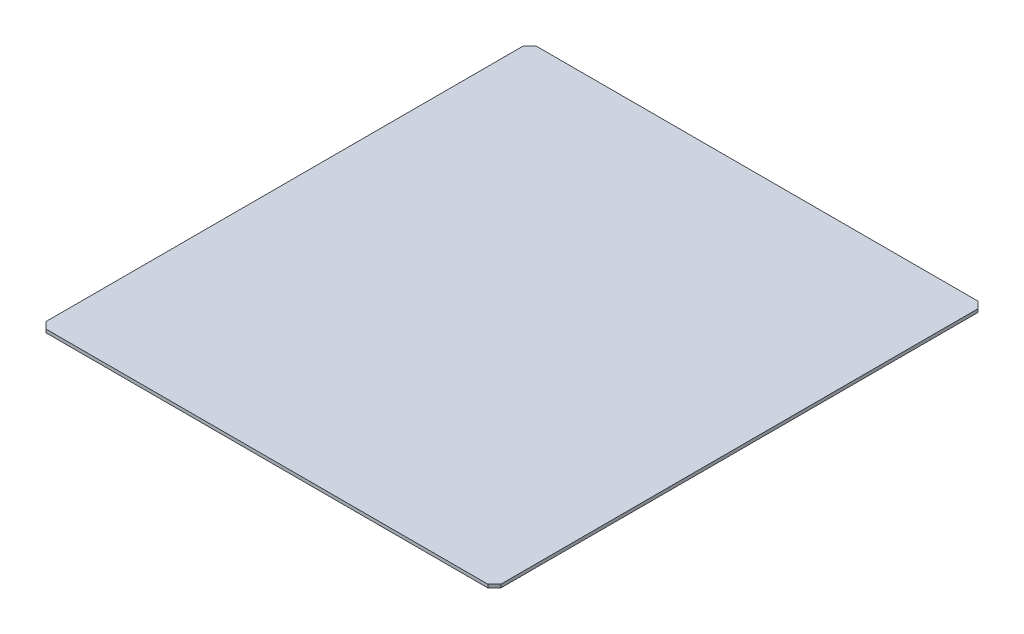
from build123d import *

# Parameters (mm, degrees)
BASE_EXTRU_MINCE_DEPTH  = 100
ESQUISSE3_R             = 4.5
ENL_V_MAT_EXTRU_1_DEPTH = 172.172427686
BOSS_EXTRU_1_DEPTH      = 5


with BuildPart() as part:
    # Esquisse2 → Base-Extru.-Mince (new body)
    with BuildSketch(Plane.XY):
        with BuildLine():
            Line((-60, -50), (-60, 46))
            ThreePointArc((-60, 46), (-58.828427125, 48.828427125), (-56, 50))
            Line((-56, 50), (56, 50))
            ThreePointArc((56, 50), (58.828427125, 48.828427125), (60, 46))
            Line((60, 46), (60, -50))
            Line((60, -50), (64, -50))
            Line((64, -50), (64, 46))
            ThreePointArc((64, 46), (61.656854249, 51.656854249), (56, 54))
            Line((56, 54), (-56, 54))
            ThreePointArc((-56, 54), (-61.656854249, 51.656854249), (-64, 46))
            Line((-64, 46), (-64, -50))
            Line((-64, -50), (-60, -50))
        make_face()
    extrude(amount=BASE_EXTRU_MINCE_DEPTH)

    # Esquisse3 → Enl_v. mat.-Extru.1 (cut, through all)
    with BuildSketch(Plane(origin=(64, 0, 0), x_dir=(0, 0, -1), z_dir=(1, 0, 0))):
        with Locations(Location((-90, -4, 0), (0, 0, 90))):
            Circle(ESQUISSE3_R)
        with Locations(Location((-10, -4, 0), (0, 0, 90))):
            Circle(ESQUISSE3_R)
    extrude(amount=-ENL_V_MAT_EXTRU_1_DEPTH, mode=Mode.SUBTRACT)

    # Esquisse4 → Boss.-Extru.1 (add)
    with BuildSketch(Plane(origin=(0, 54, 0), x_dir=(-1, 0, 0), z_dir=(0, 1, 0))):
        Polygon((-348, 10), (-338, 0), (338, 0), (348, 10), (348, 740), (338, 750), (-338, 750), (-348, 740), align=None)
    extrude(amount=BOSS_EXTRU_1_DEPTH)


solid = part.part
